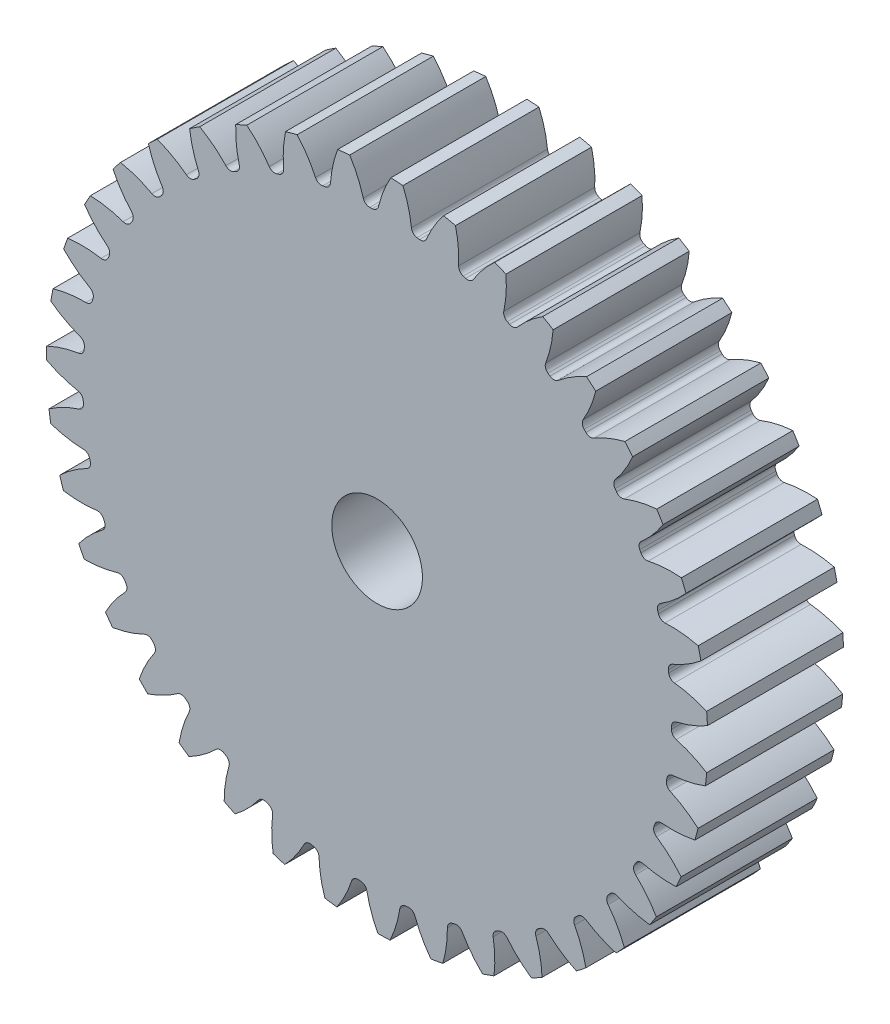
from build123d import *

# Parameters (mm, degrees)
SKETCH3_R         = 231.422222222
GEARBODY_DEPTH    = 95.25
TOOTHCUT_DEPTH    = 341.859285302
CIRPATTERN1_COUNT = 39
BOREDIA_R         = 31.75
BORE_DEPTH        = 12700


with BuildPart() as part:
    # Sketch3 → gearBody (new body)
    with BuildSketch(Plane.XY):
        Circle(SKETCH3_R)
    extrude(amount=GEARBODY_DEPTH)

    # Sketch2 → toothCut (cut, through all)
    with BuildSketch(Plane.XY):
        with BuildLine():
            ThreePointArc((205.963966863, -4.899020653), (205.982972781, -4.021314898), (205.998238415, -3.143536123))
            ThreePointArc((205.998238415, -3.143536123), (207.010770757, -0.335633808), (209.534879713, 1.257605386))
            ThreePointArc((209.534879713, 1.257605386), (220.802001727, 4.818310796), (231.422222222, 9.998810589))
            ThreePointArc((231.422222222, 9.998810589), (231.593995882, -4.521307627), (230.855629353, -19.023657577))
            ThreePointArc((230.855629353, -19.023657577), (220.44569732, -13.432595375), (209.326135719, -9.434844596))
            ThreePointArc((209.326135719, -9.434844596), (206.866134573, -7.744302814), (205.963966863, -4.899020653))
        make_face()
    toothcut = extrude(amount=TOOTHCUT_DEPTH, mode=Mode.SUBTRACT)

    # CirPattern1: toothCut ×39 about axis
    cirpattern1_axis = Axis((0, 0, 0), (0, 0, 1))
    for i in range(1, CIRPATTERN1_COUNT):
        add(toothcut.rotate(cirpattern1_axis, i * 360 / CIRPATTERN1_COUNT), mode=Mode.SUBTRACT)

    # boreDia → bore (cut, symmetric)
    with BuildSketch(Plane.XY):
        Circle(BOREDIA_R)
    extrude(amount=BORE_DEPTH, both=True, mode=Mode.SUBTRACT)


solid = part.part
